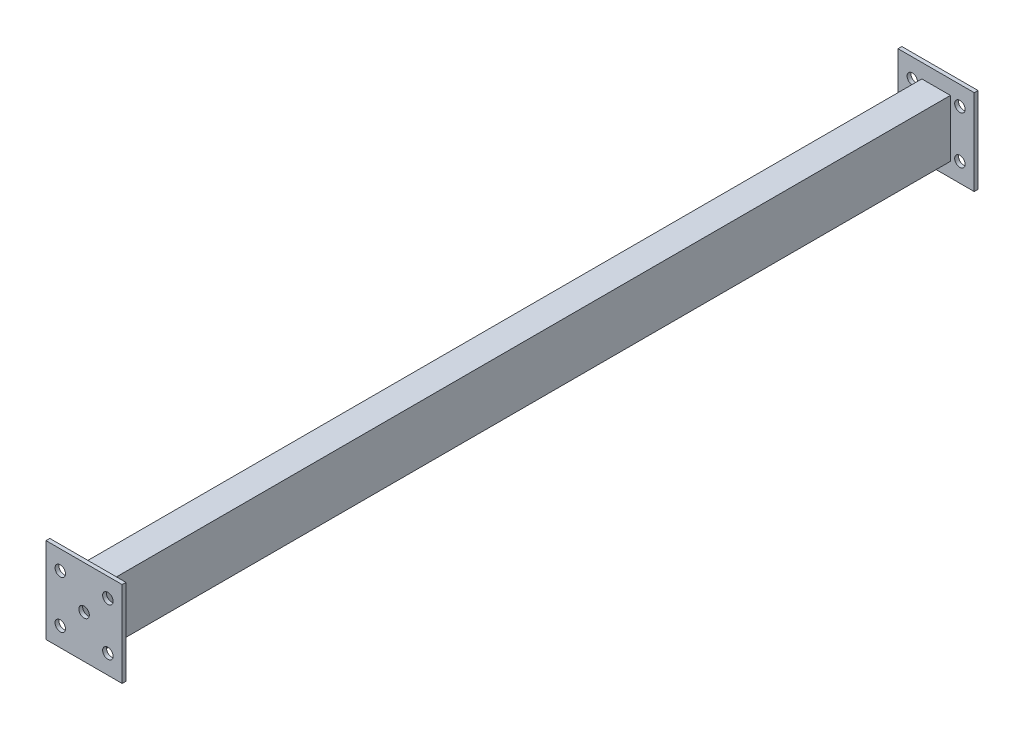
ISO-10303-21;
HEADER;
FILE_DESCRIPTION(('STEP AP214'),'2;1');
FILE_NAME('part.step','',(''),(''),'','','');
FILE_SCHEMA(('AUTOMOTIVE_DESIGN { 1 0 10303 214 1 1 1 1 }'));
ENDSEC;
DATA;
#1=APPLICATION_CONTEXT('core data for automotive mechanical design processes');
#2=APPLICATION_PROTOCOL_DEFINITION('international standard','automotive_design',2000,#1);
#3=PRODUCT_CONTEXT('',#1,'mechanical');
#4=PRODUCT('Part','Part','',(#3));
#5=PRODUCT_RELATED_PRODUCT_CATEGORY('part','',(#4));
#6=PRODUCT_DEFINITION_FORMATION('','',#4);
#7=PRODUCT_DEFINITION_CONTEXT('part definition',#1,'design');
#8=PRODUCT_DEFINITION('design','',#6,#7);
#9=PRODUCT_DEFINITION_SHAPE('','',#8);
#10=(LENGTH_UNIT() NAMED_UNIT(*) SI_UNIT(.MILLI.,.METRE.));
#11=(NAMED_UNIT(*) PLANE_ANGLE_UNIT() SI_UNIT($,.RADIAN.));
#12=(NAMED_UNIT(*) SI_UNIT($,.STERADIAN.) SOLID_ANGLE_UNIT());
#13=UNCERTAINTY_MEASURE_WITH_UNIT(LENGTH_MEASURE(1.E-05),#10,'distance_accuracy_value','');
#14=(GEOMETRIC_REPRESENTATION_CONTEXT(3) GLOBAL_UNCERTAINTY_ASSIGNED_CONTEXT((#13)) GLOBAL_UNIT_ASSIGNED_CONTEXT((#10,
#11,#12)) REPRESENTATION_CONTEXT('',''));
#15=CARTESIAN_POINT('',(0.,0.,0.));
#16=DIRECTION('',(0.,0.,1.));
#17=DIRECTION('',(1.,0.,0.));
#18=AXIS2_PLACEMENT_3D('',#15,#16,#17);
#19=CARTESIAN_POINT('',(-15.,30.,445.5));
#20=DIRECTION('',(1.,0.,0.));
#21=DIRECTION('',(0.,1.,0.));
#22=AXIS2_PLACEMENT_3D('',#19,#20,#21);
#23=PLANE('',#22);
#24=DIRECTION('',(0.,0.,-1.));
#25=VECTOR('',#24,1.);
#26=CARTESIAN_POINT('',(-15.,30.,445.5));
#27=LINE('',#26,#25);
#28=CARTESIAN_POINT('',(-15.,30.,445.5));
#29=VERTEX_POINT('',#28);
#30=CARTESIAN_POINT('',(-15.,30.,-445.5));
#31=VERTEX_POINT('',#30);
#32=EDGE_CURVE('E299',#29,#31,#27,.T.);
#33=ORIENTED_EDGE('',*,*,#32,.T.);
#34=DIRECTION('',(0.,-1.,0.));
#35=VECTOR('',#34,1.);
#36=CARTESIAN_POINT('',(-15.,30.,-445.5));
#37=LINE('',#36,#35);
#38=CARTESIAN_POINT('',(-15.,-30.,-445.5));
#39=VERTEX_POINT('',#38);
#40=EDGE_CURVE('E196',#31,#39,#37,.T.);
#41=ORIENTED_EDGE('',*,*,#40,.T.);
#42=DIRECTION('',(0.,0.,-1.));
#43=VECTOR('',#42,1.);
#44=CARTESIAN_POINT('',(-15.,-30.,445.5));
#45=LINE('',#44,#43);
#46=CARTESIAN_POINT('',(-15.,-30.,445.5));
#47=VERTEX_POINT('',#46);
#48=EDGE_CURVE('E11',#47,#39,#45,.T.);
#49=ORIENTED_EDGE('',*,*,#48,.F.);
#50=DIRECTION('',(0.,-1.,0.));
#51=VECTOR('',#50,1.);
#52=CARTESIAN_POINT('',(-15.,30.,445.5));
#53=LINE('',#52,#51);
#54=EDGE_CURVE('E287',#29,#47,#53,.T.);
#55=ORIENTED_EDGE('',*,*,#54,.F.);
#56=EDGE_LOOP('',(#33,#41,#49,#55));
#57=FACE_BOUND('',#56,.T.);
#58=ADVANCED_FACE('F26',(#57),#23,.F.);
#59=CARTESIAN_POINT('',(-15.,-30.,445.5));
#60=DIRECTION('',(0.,1.,0.));
#61=DIRECTION('',(0.,0.,1.));
#62=AXIS2_PLACEMENT_3D('',#59,#60,#61);
#63=PLANE('',#62);
#64=ORIENTED_EDGE('',*,*,#48,.T.);
#65=DIRECTION('',(1.,0.,0.));
#66=VECTOR('',#65,1.);
#67=CARTESIAN_POINT('',(-15.,-30.,-445.5));
#68=LINE('',#67,#66);
#69=CARTESIAN_POINT('',(15.,-30.,-445.5));
#70=VERTEX_POINT('',#69);
#71=EDGE_CURVE('E204',#39,#70,#68,.T.);
#72=ORIENTED_EDGE('',*,*,#71,.T.);
#73=DIRECTION('',(0.,0.,-1.));
#74=VECTOR('',#73,1.);
#75=CARTESIAN_POINT('',(15.,-30.,445.5));
#76=LINE('',#75,#74);
#77=CARTESIAN_POINT('',(15.,-30.,445.5));
#78=VERTEX_POINT('',#77);
#79=EDGE_CURVE('E33',#78,#70,#76,.T.);
#80=ORIENTED_EDGE('',*,*,#79,.F.);
#81=DIRECTION('',(1.,0.,0.));
#82=VECTOR('',#81,1.);
#83=CARTESIAN_POINT('',(-15.,-30.,445.5));
#84=LINE('',#83,#82);
#85=EDGE_CURVE('E290',#47,#78,#84,.T.);
#86=ORIENTED_EDGE('',*,*,#85,.F.);
#87=EDGE_LOOP('',(#64,#72,#80,#86));
#88=FACE_BOUND('',#87,.T.);
#89=ADVANCED_FACE('F303',(#88),#63,.F.);
#90=CARTESIAN_POINT('',(15.,30.,445.5));
#91=DIRECTION('',(-1.,0.,0.));
#92=DIRECTION('',(0.,-1.,0.));
#93=AXIS2_PLACEMENT_3D('',#90,#91,#92);
#94=PLANE('',#93);
#95=ORIENTED_EDGE('',*,*,#79,.T.);
#96=DIRECTION('',(0.,1.,0.));
#97=VECTOR('',#96,1.);
#98=CARTESIAN_POINT('',(15.,30.,-445.5));
#99=LINE('',#98,#97);
#100=CARTESIAN_POINT('',(15.,30.,-445.5));
#101=VERTEX_POINT('',#100);
#102=EDGE_CURVE('E202',#70,#101,#99,.T.);
#103=ORIENTED_EDGE('',*,*,#102,.T.);
#104=DIRECTION('',(0.,0.,-1.));
#105=VECTOR('',#104,1.);
#106=CARTESIAN_POINT('',(15.,30.,445.5));
#107=LINE('',#106,#105);
#108=CARTESIAN_POINT('',(15.,30.,445.5));
#109=VERTEX_POINT('',#108);
#110=EDGE_CURVE('E40',#109,#101,#107,.T.);
#111=ORIENTED_EDGE('',*,*,#110,.F.);
#112=DIRECTION('',(0.,1.,0.));
#113=VECTOR('',#112,1.);
#114=CARTESIAN_POINT('',(15.,30.,445.5));
#115=LINE('',#114,#113);
#116=EDGE_CURVE('E293',#78,#109,#115,.T.);
#117=ORIENTED_EDGE('',*,*,#116,.F.);
#118=EDGE_LOOP('',(#95,#103,#111,#117));
#119=FACE_BOUND('',#118,.T.);
#120=ADVANCED_FACE('F302',(#119),#94,.F.);
#121=CARTESIAN_POINT('',(-15.,30.,445.5));
#122=DIRECTION('',(0.,-1.,0.));
#123=DIRECTION('',(0.,0.,-1.));
#124=AXIS2_PLACEMENT_3D('',#121,#122,#123);
#125=PLANE('',#124);
#126=ORIENTED_EDGE('',*,*,#110,.T.);
#127=DIRECTION('',(-1.,0.,0.));
#128=VECTOR('',#127,1.);
#129=CARTESIAN_POINT('',(-15.,30.,-445.5));
#130=LINE('',#129,#128);
#131=EDGE_CURVE('E199',#101,#31,#130,.T.);
#132=ORIENTED_EDGE('',*,*,#131,.T.);
#133=ORIENTED_EDGE('',*,*,#32,.F.);
#134=DIRECTION('',(-1.,0.,0.));
#135=VECTOR('',#134,1.);
#136=CARTESIAN_POINT('',(-15.,30.,445.5));
#137=LINE('',#136,#135);
#138=EDGE_CURVE('E296',#109,#29,#137,.T.);
#139=ORIENTED_EDGE('',*,*,#138,.F.);
#140=EDGE_LOOP('',(#126,#132,#133,#139));
#141=FACE_BOUND('',#140,.T.);
#142=ADVANCED_FACE('F307',(#141),#125,.F.);
#143=CARTESIAN_POINT('',(-12.5,27.5,445.5));
#144=DIRECTION('',(1.,0.,0.));
#145=DIRECTION('',(0.,1.,0.));
#146=AXIS2_PLACEMENT_3D('',#143,#144,#145);
#147=PLANE('',#146);
#148=DIRECTION('',(0.,0.,-1.));
#149=VECTOR('',#148,1.);
#150=CARTESIAN_POINT('',(-12.5,-27.5,445.5));
#151=LINE('',#150,#149);
#152=CARTESIAN_POINT('',(-12.5,-27.5,445.5));
#153=VERTEX_POINT('',#152);
#154=CARTESIAN_POINT('',(-12.5,-27.5,-445.5));
#155=VERTEX_POINT('',#154);
#156=EDGE_CURVE('E285',#153,#155,#151,.T.);
#157=ORIENTED_EDGE('',*,*,#156,.T.);
#158=DIRECTION('',(0.,-1.,0.));
#159=VECTOR('',#158,1.);
#160=CARTESIAN_POINT('',(-12.5,27.5,-445.5));
#161=LINE('',#160,#159);
#162=CARTESIAN_POINT('',(-12.5,27.5,-445.5));
#163=VERTEX_POINT('',#162);
#164=EDGE_CURVE('E150',#163,#155,#161,.T.);
#165=ORIENTED_EDGE('',*,*,#164,.F.);
#166=DIRECTION('',(0.,0.,-1.));
#167=VECTOR('',#166,1.);
#168=CARTESIAN_POINT('',(-12.5,27.5,445.5));
#169=LINE('',#168,#167);
#170=CARTESIAN_POINT('',(-12.5,27.5,445.5));
#171=VERTEX_POINT('',#170);
#172=EDGE_CURVE('E278',#171,#163,#169,.T.);
#173=ORIENTED_EDGE('',*,*,#172,.F.);
#174=DIRECTION('',(0.,-1.,0.));
#175=VECTOR('',#174,1.);
#176=CARTESIAN_POINT('',(-12.5,27.5,445.5));
#177=LINE('',#176,#175);
#178=EDGE_CURVE('E266',#171,#153,#177,.T.);
#179=ORIENTED_EDGE('',*,*,#178,.T.);
#180=EDGE_LOOP('',(#157,#165,#173,#179));
#181=FACE_BOUND('',#180,.T.);
#182=ADVANCED_FACE('F323',(#181),#147,.T.);
#183=CARTESIAN_POINT('',(-12.5,-27.5,445.5));
#184=DIRECTION('',(0.,1.,0.));
#185=DIRECTION('',(0.,0.,1.));
#186=AXIS2_PLACEMENT_3D('',#183,#184,#185);
#187=PLANE('',#186);
#188=DIRECTION('',(0.,0.,-1.));
#189=VECTOR('',#188,1.);
#190=CARTESIAN_POINT('',(12.5,-27.5,445.5));
#191=LINE('',#190,#189);
#192=CARTESIAN_POINT('',(12.5,-27.5,445.5));
#193=VERTEX_POINT('',#192);
#194=CARTESIAN_POINT('',(12.5,-27.5,-445.5));
#195=VERTEX_POINT('',#194);
#196=EDGE_CURVE('E283',#193,#195,#191,.T.);
#197=ORIENTED_EDGE('',*,*,#196,.T.);
#198=DIRECTION('',(1.,0.,0.));
#199=VECTOR('',#198,1.);
#200=CARTESIAN_POINT('',(-12.5,-27.5,-445.5));
#201=LINE('',#200,#199);
#202=EDGE_CURVE('E193',#155,#195,#201,.T.);
#203=ORIENTED_EDGE('',*,*,#202,.F.);
#204=ORIENTED_EDGE('',*,*,#156,.F.);
#205=DIRECTION('',(1.,0.,0.));
#206=VECTOR('',#205,1.);
#207=CARTESIAN_POINT('',(-12.5,-27.5,445.5));
#208=LINE('',#207,#206);
#209=EDGE_CURVE('E269',#153,#193,#208,.T.);
#210=ORIENTED_EDGE('',*,*,#209,.T.);
#211=EDGE_LOOP('',(#197,#203,#204,#210));
#212=FACE_BOUND('',#211,.T.);
#213=ADVANCED_FACE('F326',(#212),#187,.T.);
#214=CARTESIAN_POINT('',(12.5,27.5,445.5));
#215=DIRECTION('',(-1.,0.,0.));
#216=DIRECTION('',(0.,-1.,0.));
#217=AXIS2_PLACEMENT_3D('',#214,#215,#216);
#218=PLANE('',#217);
#219=DIRECTION('',(0.,0.,-1.));
#220=VECTOR('',#219,1.);
#221=CARTESIAN_POINT('',(12.5,27.5,445.5));
#222=LINE('',#221,#220);
#223=CARTESIAN_POINT('',(12.5,27.5,445.5));
#224=VERTEX_POINT('',#223);
#225=CARTESIAN_POINT('',(12.5,27.5,-445.5));
#226=VERTEX_POINT('',#225);
#227=EDGE_CURVE('E281',#224,#226,#222,.T.);
#228=ORIENTED_EDGE('',*,*,#227,.T.);
#229=DIRECTION('',(0.,1.,0.));
#230=VECTOR('',#229,1.);
#231=CARTESIAN_POINT('',(12.5,27.5,-445.5));
#232=LINE('',#231,#230);
#233=EDGE_CURVE('E190',#195,#226,#232,.T.);
#234=ORIENTED_EDGE('',*,*,#233,.F.);
#235=ORIENTED_EDGE('',*,*,#196,.F.);
#236=DIRECTION('',(0.,1.,0.));
#237=VECTOR('',#236,1.);
#238=CARTESIAN_POINT('',(12.5,27.5,445.5));
#239=LINE('',#238,#237);
#240=EDGE_CURVE('E272',#193,#224,#239,.T.);
#241=ORIENTED_EDGE('',*,*,#240,.T.);
#242=EDGE_LOOP('',(#228,#234,#235,#241));
#243=FACE_BOUND('',#242,.T.);
#244=ADVANCED_FACE('F330',(#243),#218,.T.);
#245=CARTESIAN_POINT('',(-12.5,27.5,445.5));
#246=DIRECTION('',(0.,-1.,0.));
#247=DIRECTION('',(0.,0.,-1.));
#248=AXIS2_PLACEMENT_3D('',#245,#246,#247);
#249=PLANE('',#248);
#250=ORIENTED_EDGE('',*,*,#172,.T.);
#251=DIRECTION('',(-1.,0.,0.));
#252=VECTOR('',#251,1.);
#253=CARTESIAN_POINT('',(-12.5,27.5,-445.5));
#254=LINE('',#253,#252);
#255=EDGE_CURVE('E187',#226,#163,#254,.T.);
#256=ORIENTED_EDGE('',*,*,#255,.F.);
#257=ORIENTED_EDGE('',*,*,#227,.F.);
#258=DIRECTION('',(-1.,0.,0.));
#259=VECTOR('',#258,1.);
#260=CARTESIAN_POINT('',(-12.5,27.5,445.5));
#261=LINE('',#260,#259);
#262=EDGE_CURVE('E275',#224,#171,#261,.T.);
#263=ORIENTED_EDGE('',*,*,#262,.T.);
#264=EDGE_LOOP('',(#250,#256,#257,#263));
#265=FACE_BOUND('',#264,.T.);
#266=ADVANCED_FACE('F334',(#265),#249,.T.);
#267=CARTESIAN_POINT('',(-40.,-45.,445.5));
#268=DIRECTION('',(0.,0.,1.));
#269=DIRECTION('',(1.,0.,0.));
#270=AXIS2_PLACEMENT_3D('',#267,#268,#269);
#271=PLANE('',#270);
#272=CARTESIAN_POINT('',(25.,-25.,445.5));
#273=DIRECTION('',(0.,0.,1.));
#274=DIRECTION('',(1.,0.,0.));
#275=AXIS2_PLACEMENT_3D('',#272,#273,#274);
#276=CIRCLE('',#275,5.5);
#277=CARTESIAN_POINT('',(30.5,-25.,445.5));
#278=VERTEX_POINT('',#277);
#279=EDGE_CURVE('E212',#278,#278,#276,.T.);
#280=ORIENTED_EDGE('',*,*,#279,.T.);
#281=EDGE_LOOP('',(#280));
#282=FACE_BOUND('',#281,.T.);
#283=CARTESIAN_POINT('',(25.,25.,445.5));
#284=DIRECTION('',(0.,0.,1.));
#285=DIRECTION('',(1.,0.,0.));
#286=AXIS2_PLACEMENT_3D('',#283,#284,#285);
#287=CIRCLE('',#286,5.5);
#288=CARTESIAN_POINT('',(30.5,25.,445.5));
#289=VERTEX_POINT('',#288);
#290=EDGE_CURVE('E224',#289,#289,#287,.T.);
#291=ORIENTED_EDGE('',*,*,#290,.T.);
#292=EDGE_LOOP('',(#291));
#293=FACE_BOUND('',#292,.T.);
#294=DIRECTION('',(0.,-1.,0.));
#295=VECTOR('',#294,1.);
#296=CARTESIAN_POINT('',(-40.,45.,445.5));
#297=LINE('',#296,#295);
#298=CARTESIAN_POINT('',(-40.,45.,445.5));
#299=VERTEX_POINT('',#298);
#300=CARTESIAN_POINT('',(-40.,-45.,445.5));
#301=VERTEX_POINT('',#300);
#302=EDGE_CURVE('E236',#299,#301,#297,.T.);
#303=ORIENTED_EDGE('',*,*,#302,.F.);
#304=DIRECTION('',(-1.,0.,0.));
#305=VECTOR('',#304,1.);
#306=CARTESIAN_POINT('',(-40.,45.,445.5));
#307=LINE('',#306,#305);
#308=CARTESIAN_POINT('',(40.,45.,445.5));
#309=VERTEX_POINT('',#308);
#310=EDGE_CURVE('E243',#309,#299,#307,.T.);
#311=ORIENTED_EDGE('',*,*,#310,.F.);
#312=DIRECTION('',(0.,1.,0.));
#313=VECTOR('',#312,1.);
#314=CARTESIAN_POINT('',(40.,45.,445.5));
#315=LINE('',#314,#313);
#316=CARTESIAN_POINT('',(40.,-45.,445.5));
#317=VERTEX_POINT('',#316);
#318=EDGE_CURVE('E241',#317,#309,#315,.T.);
#319=ORIENTED_EDGE('',*,*,#318,.F.);
#320=DIRECTION('',(1.,0.,0.));
#321=VECTOR('',#320,1.);
#322=CARTESIAN_POINT('',(-40.,-45.,445.5));
#323=LINE('',#322,#321);
#324=EDGE_CURVE('E239',#301,#317,#323,.T.);
#325=ORIENTED_EDGE('',*,*,#324,.F.);
#326=EDGE_LOOP('',(#303,#311,#319,#325));
#327=FACE_BOUND('',#326,.T.);
#328=CARTESIAN_POINT('',(-25.,25.,445.5));
#329=DIRECTION('',(0.,0.,1.));
#330=DIRECTION('',(1.,0.,0.));
#331=AXIS2_PLACEMENT_3D('',#328,#329,#330);
#332=CIRCLE('',#331,5.5);
#333=CARTESIAN_POINT('',(-19.5,25.,445.5));
#334=VERTEX_POINT('',#333);
#335=EDGE_CURVE('E230',#334,#334,#332,.T.);
#336=ORIENTED_EDGE('',*,*,#335,.T.);
#337=EDGE_LOOP('',(#336));
#338=FACE_BOUND('',#337,.T.);
#339=CARTESIAN_POINT('',(-25.,-25.,445.5));
#340=DIRECTION('',(0.,0.,1.));
#341=DIRECTION('',(1.,0.,0.));
#342=AXIS2_PLACEMENT_3D('',#339,#340,#341);
#343=CIRCLE('',#342,5.5);
#344=CARTESIAN_POINT('',(-19.5,-25.,445.5));
#345=VERTEX_POINT('',#344);
#346=EDGE_CURVE('E218',#345,#345,#343,.T.);
#347=ORIENTED_EDGE('',*,*,#346,.T.);
#348=EDGE_LOOP('',(#347));
#349=FACE_BOUND('',#348,.T.);
#350=ORIENTED_EDGE('',*,*,#138,.T.);
#351=ORIENTED_EDGE('',*,*,#54,.T.);
#352=ORIENTED_EDGE('',*,*,#85,.T.);
#353=ORIENTED_EDGE('',*,*,#116,.T.);
#354=EDGE_LOOP('',(#350,#351,#352,#353));
#355=FACE_BOUND('',#354,.T.);
#356=ADVANCED_FACE('F309',(#282,#293,#327,#338,#349,#355),#271,.F.);
#357=CARTESIAN_POINT('',(-40.,-45.,449.5));
#358=DIRECTION('',(0.,0.,1.));
#359=DIRECTION('',(1.,0.,0.));
#360=AXIS2_PLACEMENT_3D('',#357,#358,#359);
#361=PLANE('',#360);
#362=CARTESIAN_POINT('',(25.,-25.,449.5));
#363=DIRECTION('',(0.,0.,1.));
#364=DIRECTION('',(1.,0.,0.));
#365=AXIS2_PLACEMENT_3D('',#362,#363,#364);
#366=CIRCLE('',#365,5.5);
#367=CARTESIAN_POINT('',(30.5,-25.,449.5));
#368=VERTEX_POINT('',#367);
#369=EDGE_CURVE('E215',#368,#368,#366,.T.);
#370=ORIENTED_EDGE('',*,*,#369,.F.);
#371=EDGE_LOOP('',(#370));
#372=FACE_BOUND('',#371,.T.);
#373=CARTESIAN_POINT('',(25.,25.,449.5));
#374=DIRECTION('',(0.,0.,1.));
#375=DIRECTION('',(1.,0.,0.));
#376=AXIS2_PLACEMENT_3D('',#373,#374,#375);
#377=CIRCLE('',#376,5.5);
#378=CARTESIAN_POINT('',(30.5,25.,449.5));
#379=VERTEX_POINT('',#378);
#380=EDGE_CURVE('E227',#379,#379,#377,.T.);
#381=ORIENTED_EDGE('',*,*,#380,.F.);
#382=EDGE_LOOP('',(#381));
#383=FACE_BOUND('',#382,.T.);
#384=DIRECTION('',(0.,-1.,0.));
#385=VECTOR('',#384,1.);
#386=CARTESIAN_POINT('',(-40.,45.,449.5));
#387=LINE('',#386,#385);
#388=CARTESIAN_POINT('',(-40.,45.,449.5));
#389=VERTEX_POINT('',#388);
#390=CARTESIAN_POINT('',(-40.,-45.,449.5));
#391=VERTEX_POINT('',#390);
#392=EDGE_CURVE('E245',#389,#391,#387,.T.);
#393=ORIENTED_EDGE('',*,*,#392,.T.);
#394=DIRECTION('',(1.,0.,0.));
#395=VECTOR('',#394,1.);
#396=CARTESIAN_POINT('',(-40.,-45.,449.5));
#397=LINE('',#396,#395);
#398=CARTESIAN_POINT('',(40.,-45.,449.5));
#399=VERTEX_POINT('',#398);
#400=EDGE_CURVE('E248',#391,#399,#397,.T.);
#401=ORIENTED_EDGE('',*,*,#400,.T.);
#402=DIRECTION('',(0.,1.,0.));
#403=VECTOR('',#402,1.);
#404=CARTESIAN_POINT('',(40.,45.,449.5));
#405=LINE('',#404,#403);
#406=CARTESIAN_POINT('',(40.,45.,449.5));
#407=VERTEX_POINT('',#406);
#408=EDGE_CURVE('E250',#399,#407,#405,.T.);
#409=ORIENTED_EDGE('',*,*,#408,.T.);
#410=DIRECTION('',(-1.,0.,0.));
#411=VECTOR('',#410,1.);
#412=CARTESIAN_POINT('',(-40.,45.,449.5));
#413=LINE('',#412,#411);
#414=EDGE_CURVE('E252',#407,#389,#413,.T.);
#415=ORIENTED_EDGE('',*,*,#414,.T.);
#416=EDGE_LOOP('',(#393,#401,#409,#415));
#417=FACE_BOUND('',#416,.T.);
#418=CARTESIAN_POINT('',(-25.,25.,449.5));
#419=DIRECTION('',(0.,0.,1.));
#420=DIRECTION('',(1.,0.,0.));
#421=AXIS2_PLACEMENT_3D('',#418,#419,#420);
#422=CIRCLE('',#421,5.5);
#423=CARTESIAN_POINT('',(-19.5,25.,449.5));
#424=VERTEX_POINT('',#423);
#425=EDGE_CURVE('E233',#424,#424,#422,.T.);
#426=ORIENTED_EDGE('',*,*,#425,.F.);
#427=EDGE_LOOP('',(#426));
#428=FACE_BOUND('',#427,.T.);
#429=CARTESIAN_POINT('',(-25.,-25.,449.5));
#430=DIRECTION('',(0.,0.,1.));
#431=DIRECTION('',(1.,0.,0.));
#432=AXIS2_PLACEMENT_3D('',#429,#430,#431);
#433=CIRCLE('',#432,5.5);
#434=CARTESIAN_POINT('',(-19.5,-25.,449.5));
#435=VERTEX_POINT('',#434);
#436=EDGE_CURVE('E221',#435,#435,#433,.T.);
#437=ORIENTED_EDGE('',*,*,#436,.F.);
#438=EDGE_LOOP('',(#437));
#439=FACE_BOUND('',#438,.T.);
#440=CARTESIAN_POINT('',(0.,0.,449.5));
#441=DIRECTION('',(0.,0.,1.));
#442=DIRECTION('',(1.,0.,0.));
#443=AXIS2_PLACEMENT_3D('',#440,#441,#442);
#444=CIRCLE('',#443,5.5);
#445=CARTESIAN_POINT('',(5.5,0.,449.5));
#446=VERTEX_POINT('',#445);
#447=EDGE_CURVE('E209',#446,#446,#444,.T.);
#448=ORIENTED_EDGE('',*,*,#447,.F.);
#449=EDGE_LOOP('',(#448));
#450=FACE_BOUND('',#449,.T.);
#451=ADVANCED_FACE('F357',(#372,#383,#417,#428,#439,#450),#361,.T.);
#452=ORIENTED_EDGE('',*,*,#178,.F.);
#453=ORIENTED_EDGE('',*,*,#262,.F.);
#454=ORIENTED_EDGE('',*,*,#240,.F.);
#455=ORIENTED_EDGE('',*,*,#209,.F.);
#456=EDGE_LOOP('',(#452,#453,#454,#455));
#457=FACE_BOUND('',#456,.T.);
#458=CARTESIAN_POINT('',(0.,0.,445.5));
#459=DIRECTION('',(0.,0.,1.));
#460=DIRECTION('',(1.,0.,0.));
#461=AXIS2_PLACEMENT_3D('',#458,#459,#460);
#462=CIRCLE('',#461,5.5);
#463=CARTESIAN_POINT('',(5.5,0.,445.5));
#464=VERTEX_POINT('',#463);
#465=EDGE_CURVE('E206',#464,#464,#462,.T.);
#466=ORIENTED_EDGE('',*,*,#465,.T.);
#467=EDGE_LOOP('',(#466));
#468=FACE_BOUND('',#467,.T.);
#469=ADVANCED_FACE('F343',(#457,#468),#271,.F.);
#470=CARTESIAN_POINT('',(-40.,45.,449.5));
#471=DIRECTION('',(1.,0.,0.));
#472=DIRECTION('',(0.,1.,0.));
#473=AXIS2_PLACEMENT_3D('',#470,#471,#472);
#474=PLANE('',#473);
#475=ORIENTED_EDGE('',*,*,#302,.T.);
#476=DIRECTION('',(0.,0.,-1.));
#477=VECTOR('',#476,1.);
#478=CARTESIAN_POINT('',(-40.,-45.,449.5));
#479=LINE('',#478,#477);
#480=EDGE_CURVE('E263',#391,#301,#479,.T.);
#481=ORIENTED_EDGE('',*,*,#480,.F.);
#482=ORIENTED_EDGE('',*,*,#392,.F.);
#483=DIRECTION('',(0.,0.,-1.));
#484=VECTOR('',#483,1.);
#485=CARTESIAN_POINT('',(-40.,45.,449.5));
#486=LINE('',#485,#484);
#487=EDGE_CURVE('E254',#389,#299,#486,.T.);
#488=ORIENTED_EDGE('',*,*,#487,.T.);
#489=EDGE_LOOP('',(#475,#481,#482,#488));
#490=FACE_BOUND('',#489,.T.);
#491=ADVANCED_FACE('F339',(#490),#474,.F.);
#492=CARTESIAN_POINT('',(-40.,-45.,449.5));
#493=DIRECTION('',(0.,1.,0.));
#494=DIRECTION('',(0.,0.,1.));
#495=AXIS2_PLACEMENT_3D('',#492,#493,#494);
#496=PLANE('',#495);
#497=ORIENTED_EDGE('',*,*,#324,.T.);
#498=DIRECTION('',(0.,0.,-1.));
#499=VECTOR('',#498,1.);
#500=CARTESIAN_POINT('',(40.,-45.,449.5));
#501=LINE('',#500,#499);
#502=EDGE_CURVE('E260',#399,#317,#501,.T.);
#503=ORIENTED_EDGE('',*,*,#502,.F.);
#504=ORIENTED_EDGE('',*,*,#400,.F.);
#505=ORIENTED_EDGE('',*,*,#480,.T.);
#506=EDGE_LOOP('',(#497,#503,#504,#505));
#507=FACE_BOUND('',#506,.T.);
#508=ADVANCED_FACE('F342',(#507),#496,.F.);
#509=CARTESIAN_POINT('',(40.,45.,449.5));
#510=DIRECTION('',(-1.,0.,0.));
#511=DIRECTION('',(0.,-1.,0.));
#512=AXIS2_PLACEMENT_3D('',#509,#510,#511);
#513=PLANE('',#512);
#514=ORIENTED_EDGE('',*,*,#318,.T.);
#515=DIRECTION('',(0.,0.,-1.));
#516=VECTOR('',#515,1.);
#517=CARTESIAN_POINT('',(40.,45.,449.5));
#518=LINE('',#517,#516);
#519=EDGE_CURVE('E257',#407,#309,#518,.T.);
#520=ORIENTED_EDGE('',*,*,#519,.F.);
#521=ORIENTED_EDGE('',*,*,#408,.F.);
#522=ORIENTED_EDGE('',*,*,#502,.T.);
#523=EDGE_LOOP('',(#514,#520,#521,#522));
#524=FACE_BOUND('',#523,.T.);
#525=ADVANCED_FACE('F347',(#524),#513,.F.);
#526=CARTESIAN_POINT('',(-40.,45.,449.5));
#527=DIRECTION('',(0.,-1.,0.));
#528=DIRECTION('',(0.,0.,-1.));
#529=AXIS2_PLACEMENT_3D('',#526,#527,#528);
#530=PLANE('',#529);
#531=ORIENTED_EDGE('',*,*,#310,.T.);
#532=ORIENTED_EDGE('',*,*,#487,.F.);
#533=ORIENTED_EDGE('',*,*,#414,.F.);
#534=ORIENTED_EDGE('',*,*,#519,.T.);
#535=EDGE_LOOP('',(#531,#532,#533,#534));
#536=FACE_BOUND('',#535,.T.);
#537=ADVANCED_FACE('F351',(#536),#530,.F.);
#538=CARTESIAN_POINT('',(-25.,25.,449.5));
#539=DIRECTION('',(0.,0.,-1.));
#540=DIRECTION('',(-1.,0.,0.));
#541=AXIS2_PLACEMENT_3D('',#538,#539,#540);
#542=CYLINDRICAL_SURFACE('',#541,5.5);
#543=ORIENTED_EDGE('',*,*,#425,.T.);
#544=EDGE_LOOP('',(#543));
#545=FACE_BOUND('',#544,.T.);
#546=ORIENTED_EDGE('',*,*,#335,.F.);
#547=EDGE_LOOP('',(#546));
#548=FACE_BOUND('',#547,.T.);
#549=ADVANCED_FACE('F355',(#545,#548),#542,.F.);
#550=CARTESIAN_POINT('',(25.,25.,449.5));
#551=DIRECTION('',(0.,0.,-1.));
#552=DIRECTION('',(-1.,0.,0.));
#553=AXIS2_PLACEMENT_3D('',#550,#551,#552);
#554=CYLINDRICAL_SURFACE('',#553,5.5);
#555=ORIENTED_EDGE('',*,*,#380,.T.);
#556=EDGE_LOOP('',(#555));
#557=FACE_BOUND('',#556,.T.);
#558=ORIENTED_EDGE('',*,*,#290,.F.);
#559=EDGE_LOOP('',(#558));
#560=FACE_BOUND('',#559,.T.);
#561=ADVANCED_FACE('F366',(#557,#560),#554,.F.);
#562=CARTESIAN_POINT('',(-25.,-25.,449.5));
#563=DIRECTION('',(0.,0.,-1.));
#564=DIRECTION('',(-1.,0.,0.));
#565=AXIS2_PLACEMENT_3D('',#562,#563,#564);
#566=CYLINDRICAL_SURFACE('',#565,5.5);
#567=ORIENTED_EDGE('',*,*,#436,.T.);
#568=EDGE_LOOP('',(#567));
#569=FACE_BOUND('',#568,.T.);
#570=ORIENTED_EDGE('',*,*,#346,.F.);
#571=EDGE_LOOP('',(#570));
#572=FACE_BOUND('',#571,.T.);
#573=ADVANCED_FACE('F370',(#569,#572),#566,.F.);
#574=CARTESIAN_POINT('',(25.,-25.,449.5));
#575=DIRECTION('',(0.,0.,-1.));
#576=DIRECTION('',(-1.,0.,0.));
#577=AXIS2_PLACEMENT_3D('',#574,#575,#576);
#578=CYLINDRICAL_SURFACE('',#577,5.5);
#579=ORIENTED_EDGE('',*,*,#369,.T.);
#580=EDGE_LOOP('',(#579));
#581=FACE_BOUND('',#580,.T.);
#582=ORIENTED_EDGE('',*,*,#279,.F.);
#583=EDGE_LOOP('',(#582));
#584=FACE_BOUND('',#583,.T.);
#585=ADVANCED_FACE('F374',(#581,#584),#578,.F.);
#586=CARTESIAN_POINT('',(0.,0.,449.5));
#587=DIRECTION('',(0.,0.,-1.));
#588=DIRECTION('',(-1.,0.,0.));
#589=AXIS2_PLACEMENT_3D('',#586,#587,#588);
#590=CYLINDRICAL_SURFACE('',#589,5.5);
#591=ORIENTED_EDGE('',*,*,#447,.T.);
#592=EDGE_LOOP('',(#591));
#593=FACE_BOUND('',#592,.T.);
#594=ORIENTED_EDGE('',*,*,#465,.F.);
#595=EDGE_LOOP('',(#594));
#596=FACE_BOUND('',#595,.T.);
#597=ADVANCED_FACE('F378',(#593,#596),#590,.F.);
#598=CARTESIAN_POINT('',(-40.,-45.,-445.5));
#599=DIRECTION('',(0.,0.,-1.));
#600=DIRECTION('',(1.,0.,0.));
#601=AXIS2_PLACEMENT_3D('',#598,#599,#600);
#602=PLANE('',#601);
#603=CARTESIAN_POINT('',(25.,-25.,-445.5));
#604=DIRECTION('',(0.,0.,1.));
#605=DIRECTION('',(1.,0.,0.));
#606=AXIS2_PLACEMENT_3D('',#603,#604,#605);
#607=CIRCLE('',#606,5.5);
#608=CARTESIAN_POINT('',(30.5,-25.,-445.5));
#609=VERTEX_POINT('',#608);
#610=EDGE_CURVE('E432',#609,#609,#607,.T.);
#611=ORIENTED_EDGE('',*,*,#610,.F.);
#612=EDGE_LOOP('',(#611));
#613=FACE_BOUND('',#612,.T.);
#614=CARTESIAN_POINT('',(-25.,-25.,-445.5));
#615=DIRECTION('',(0.,0.,1.));
#616=DIRECTION('',(1.,0.,0.));
#617=AXIS2_PLACEMENT_3D('',#614,#615,#616);
#618=CIRCLE('',#617,5.5);
#619=CARTESIAN_POINT('',(-19.5,-25.,-445.5));
#620=VERTEX_POINT('',#619);
#621=EDGE_CURVE('E440',#620,#620,#618,.T.);
#622=ORIENTED_EDGE('',*,*,#621,.F.);
#623=EDGE_LOOP('',(#622));
#624=FACE_BOUND('',#623,.T.);
#625=CARTESIAN_POINT('',(25.,25.,-445.5));
#626=DIRECTION('',(0.,0.,1.));
#627=DIRECTION('',(1.,0.,0.));
#628=AXIS2_PLACEMENT_3D('',#625,#626,#627);
#629=CIRCLE('',#628,5.5);
#630=CARTESIAN_POINT('',(30.5,25.,-445.5));
#631=VERTEX_POINT('',#630);
#632=EDGE_CURVE('E446',#631,#631,#629,.T.);
#633=ORIENTED_EDGE('',*,*,#632,.F.);
#634=EDGE_LOOP('',(#633));
#635=FACE_BOUND('',#634,.T.);
#636=CARTESIAN_POINT('',(-25.,25.,-445.5));
#637=DIRECTION('',(0.,0.,1.));
#638=DIRECTION('',(1.,0.,0.));
#639=AXIS2_PLACEMENT_3D('',#636,#637,#638);
#640=CIRCLE('',#639,5.5);
#641=CARTESIAN_POINT('',(-19.5,25.,-445.5));
#642=VERTEX_POINT('',#641);
#643=EDGE_CURVE('E452',#642,#642,#640,.T.);
#644=ORIENTED_EDGE('',*,*,#643,.F.);
#645=EDGE_LOOP('',(#644));
#646=FACE_BOUND('',#645,.T.);
#647=DIRECTION('',(0.,-1.,0.));
#648=VECTOR('',#647,1.);
#649=CARTESIAN_POINT('',(-40.,45.,-445.5));
#650=LINE('',#649,#648);
#651=CARTESIAN_POINT('',(-40.,45.,-445.5));
#652=VERTEX_POINT('',#651);
#653=CARTESIAN_POINT('',(-40.,-45.,-445.5));
#654=VERTEX_POINT('',#653);
#655=EDGE_CURVE('E154',#652,#654,#650,.T.);
#656=ORIENTED_EDGE('',*,*,#655,.T.);
#657=DIRECTION('',(1.,0.,0.));
#658=VECTOR('',#657,1.);
#659=CARTESIAN_POINT('',(-40.,-45.,-445.5));
#660=LINE('',#659,#658);
#661=CARTESIAN_POINT('',(40.,-45.,-445.5));
#662=VERTEX_POINT('',#661);
#663=EDGE_CURVE('E167',#654,#662,#660,.T.);
#664=ORIENTED_EDGE('',*,*,#663,.T.);
#665=DIRECTION('',(0.,1.,0.));
#666=VECTOR('',#665,1.);
#667=CARTESIAN_POINT('',(40.,45.,-445.5));
#668=LINE('',#667,#666);
#669=CARTESIAN_POINT('',(40.,45.,-445.5));
#670=VERTEX_POINT('',#669);
#671=EDGE_CURVE('E165',#662,#670,#668,.T.);
#672=ORIENTED_EDGE('',*,*,#671,.T.);
#673=DIRECTION('',(-1.,0.,0.));
#674=VECTOR('',#673,1.);
#675=CARTESIAN_POINT('',(-40.,45.,-445.5));
#676=LINE('',#675,#674);
#677=EDGE_CURVE('E143',#670,#652,#676,.T.);
#678=ORIENTED_EDGE('',*,*,#677,.T.);
#679=EDGE_LOOP('',(#656,#664,#672,#678));
#680=FACE_BOUND('',#679,.T.);
#681=ORIENTED_EDGE('',*,*,#71,.F.);
#682=ORIENTED_EDGE('',*,*,#40,.F.);
#683=ORIENTED_EDGE('',*,*,#131,.F.);
#684=ORIENTED_EDGE('',*,*,#102,.F.);
#685=EDGE_LOOP('',(#681,#682,#683,#684));
#686=FACE_BOUND('',#685,.T.);
#687=ADVANCED_FACE('F162',(#613,#624,#635,#646,#680,#686),#602,.F.);
#688=CARTESIAN_POINT('',(-40.,45.,-449.5));
#689=DIRECTION('',(-1.,0.,0.));
#690=DIRECTION('',(0.,-1.,0.));
#691=AXIS2_PLACEMENT_3D('',#688,#689,#690);
#692=PLANE('',#691);
#693=ORIENTED_EDGE('',*,*,#655,.F.);
#694=DIRECTION('',(0.,0.,1.));
#695=VECTOR('',#694,1.);
#696=CARTESIAN_POINT('',(-40.,45.,-449.5));
#697=LINE('',#696,#695);
#698=CARTESIAN_POINT('',(-40.,45.,-449.5));
#699=VERTEX_POINT('',#698);
#700=EDGE_CURVE('E139',#699,#652,#697,.T.);
#701=ORIENTED_EDGE('',*,*,#700,.F.);
#702=DIRECTION('',(0.,-1.,0.));
#703=VECTOR('',#702,1.);
#704=CARTESIAN_POINT('',(-40.,45.,-449.5));
#705=LINE('',#704,#703);
#706=CARTESIAN_POINT('',(-40.,-45.,-449.5));
#707=VERTEX_POINT('',#706);
#708=EDGE_CURVE('E172',#699,#707,#705,.T.);
#709=ORIENTED_EDGE('',*,*,#708,.T.);
#710=DIRECTION('',(0.,0.,1.));
#711=VECTOR('',#710,1.);
#712=CARTESIAN_POINT('',(-40.,-45.,-449.5));
#713=LINE('',#712,#711);
#714=EDGE_CURVE('E156',#707,#654,#713,.T.);
#715=ORIENTED_EDGE('',*,*,#714,.T.);
#716=EDGE_LOOP('',(#693,#701,#709,#715));
#717=FACE_BOUND('',#716,.T.);
#718=ADVANCED_FACE('F155',(#717),#692,.T.);
#719=CARTESIAN_POINT('',(-40.,45.,-449.5));
#720=DIRECTION('',(0.,1.,0.));
#721=DIRECTION('',(0.,0.,1.));
#722=AXIS2_PLACEMENT_3D('',#719,#720,#721);
#723=PLANE('',#722);
#724=ORIENTED_EDGE('',*,*,#677,.F.);
#725=DIRECTION('',(0.,0.,1.));
#726=VECTOR('',#725,1.);
#727=CARTESIAN_POINT('',(40.,45.,-449.5));
#728=LINE('',#727,#726);
#729=CARTESIAN_POINT('',(40.,45.,-449.5));
#730=VERTEX_POINT('',#729);
#731=EDGE_CURVE('E151',#730,#670,#728,.T.);
#732=ORIENTED_EDGE('',*,*,#731,.F.);
#733=DIRECTION('',(-1.,0.,0.));
#734=VECTOR('',#733,1.);
#735=CARTESIAN_POINT('',(-40.,45.,-449.5));
#736=LINE('',#735,#734);
#737=EDGE_CURVE('E146',#730,#699,#736,.T.);
#738=ORIENTED_EDGE('',*,*,#737,.T.);
#739=ORIENTED_EDGE('',*,*,#700,.T.);
#740=EDGE_LOOP('',(#724,#732,#738,#739));
#741=FACE_BOUND('',#740,.T.);
#742=ADVANCED_FACE('F141',(#741),#723,.T.);
#743=CARTESIAN_POINT('',(40.,45.,-449.5));
#744=DIRECTION('',(1.,0.,0.));
#745=DIRECTION('',(0.,1.,0.));
#746=AXIS2_PLACEMENT_3D('',#743,#744,#745);
#747=PLANE('',#746);
#748=ORIENTED_EDGE('',*,*,#671,.F.);
#749=DIRECTION('',(0.,0.,1.));
#750=VECTOR('',#749,1.);
#751=CARTESIAN_POINT('',(40.,-45.,-449.5));
#752=LINE('',#751,#750);
#753=CARTESIAN_POINT('',(40.,-45.,-449.5));
#754=VERTEX_POINT('',#753);
#755=EDGE_CURVE('E182',#754,#662,#752,.T.);
#756=ORIENTED_EDGE('',*,*,#755,.F.);
#757=DIRECTION('',(0.,1.,0.));
#758=VECTOR('',#757,1.);
#759=CARTESIAN_POINT('',(40.,45.,-449.5));
#760=LINE('',#759,#758);
#761=EDGE_CURVE('E175',#754,#730,#760,.T.);
#762=ORIENTED_EDGE('',*,*,#761,.T.);
#763=ORIENTED_EDGE('',*,*,#731,.T.);
#764=EDGE_LOOP('',(#748,#756,#762,#763));
#765=FACE_BOUND('',#764,.T.);
#766=ADVANCED_FACE('F386',(#765),#747,.T.);
#767=CARTESIAN_POINT('',(-40.,-45.,-449.5));
#768=DIRECTION('',(0.,-1.,0.));
#769=DIRECTION('',(0.,0.,-1.));
#770=AXIS2_PLACEMENT_3D('',#767,#768,#769);
#771=PLANE('',#770);
#772=ORIENTED_EDGE('',*,*,#663,.F.);
#773=ORIENTED_EDGE('',*,*,#714,.F.);
#774=DIRECTION('',(1.,0.,0.));
#775=VECTOR('',#774,1.);
#776=CARTESIAN_POINT('',(-40.,-45.,-449.5));
#777=LINE('',#776,#775);
#778=EDGE_CURVE('E178',#707,#754,#777,.T.);
#779=ORIENTED_EDGE('',*,*,#778,.T.);
#780=ORIENTED_EDGE('',*,*,#755,.T.);
#781=EDGE_LOOP('',(#772,#773,#779,#780));
#782=FACE_BOUND('',#781,.T.);
#783=ADVANCED_FACE('F389',(#782),#771,.T.);
#784=CARTESIAN_POINT('',(-40.,-45.,-449.5));
#785=DIRECTION('',(0.,0.,-1.));
#786=DIRECTION('',(1.,0.,0.));
#787=AXIS2_PLACEMENT_3D('',#784,#785,#786);
#788=PLANE('',#787);
#789=CARTESIAN_POINT('',(0.,0.,-449.5));
#790=DIRECTION('',(0.,0.,1.));
#791=DIRECTION('',(1.,0.,0.));
#792=AXIS2_PLACEMENT_3D('',#789,#790,#791);
#793=CIRCLE('',#792,5.5);
#794=CARTESIAN_POINT('',(5.5,0.,-449.5));
#795=VERTEX_POINT('',#794);
#796=EDGE_CURVE('E426',#795,#795,#793,.T.);
#797=ORIENTED_EDGE('',*,*,#796,.T.);
#798=EDGE_LOOP('',(#797));
#799=FACE_BOUND('',#798,.T.);
#800=CARTESIAN_POINT('',(25.,-25.,-449.5));
#801=DIRECTION('',(0.,0.,1.));
#802=DIRECTION('',(1.,0.,0.));
#803=AXIS2_PLACEMENT_3D('',#800,#801,#802);
#804=CIRCLE('',#803,5.5);
#805=CARTESIAN_POINT('',(30.5,-25.,-449.5));
#806=VERTEX_POINT('',#805);
#807=EDGE_CURVE('E437',#806,#806,#804,.T.);
#808=ORIENTED_EDGE('',*,*,#807,.T.);
#809=EDGE_LOOP('',(#808));
#810=FACE_BOUND('',#809,.T.);
#811=CARTESIAN_POINT('',(-25.,-25.,-449.5));
#812=DIRECTION('',(0.,0.,1.));
#813=DIRECTION('',(1.,0.,0.));
#814=AXIS2_PLACEMENT_3D('',#811,#812,#813);
#815=CIRCLE('',#814,5.5);
#816=CARTESIAN_POINT('',(-19.5,-25.,-449.5));
#817=VERTEX_POINT('',#816);
#818=EDGE_CURVE('E443',#817,#817,#815,.T.);
#819=ORIENTED_EDGE('',*,*,#818,.T.);
#820=EDGE_LOOP('',(#819));
#821=FACE_BOUND('',#820,.T.);
#822=CARTESIAN_POINT('',(25.,25.,-449.5));
#823=DIRECTION('',(0.,0.,1.));
#824=DIRECTION('',(1.,0.,0.));
#825=AXIS2_PLACEMENT_3D('',#822,#823,#824);
#826=CIRCLE('',#825,5.5);
#827=CARTESIAN_POINT('',(30.5,25.,-449.5));
#828=VERTEX_POINT('',#827);
#829=EDGE_CURVE('E449',#828,#828,#826,.T.);
#830=ORIENTED_EDGE('',*,*,#829,.T.);
#831=EDGE_LOOP('',(#830));
#832=FACE_BOUND('',#831,.T.);
#833=CARTESIAN_POINT('',(-25.,25.,-449.5));
#834=DIRECTION('',(0.,0.,1.));
#835=DIRECTION('',(1.,0.,0.));
#836=AXIS2_PLACEMENT_3D('',#833,#834,#835);
#837=CIRCLE('',#836,5.5);
#838=CARTESIAN_POINT('',(-19.5,25.,-449.5));
#839=VERTEX_POINT('',#838);
#840=EDGE_CURVE('E160',#839,#839,#837,.T.);
#841=ORIENTED_EDGE('',*,*,#840,.T.);
#842=EDGE_LOOP('',(#841));
#843=FACE_BOUND('',#842,.T.);
#844=ORIENTED_EDGE('',*,*,#708,.F.);
#845=ORIENTED_EDGE('',*,*,#737,.F.);
#846=ORIENTED_EDGE('',*,*,#761,.F.);
#847=ORIENTED_EDGE('',*,*,#778,.F.);
#848=EDGE_LOOP('',(#844,#845,#846,#847));
#849=FACE_BOUND('',#848,.T.);
#850=ADVANCED_FACE('F393',(#799,#810,#821,#832,#843,#849),#788,.T.);
#851=ORIENTED_EDGE('',*,*,#164,.T.);
#852=ORIENTED_EDGE('',*,*,#202,.T.);
#853=ORIENTED_EDGE('',*,*,#233,.T.);
#854=ORIENTED_EDGE('',*,*,#255,.T.);
#855=EDGE_LOOP('',(#851,#852,#853,#854));
#856=FACE_BOUND('',#855,.T.);
#857=CARTESIAN_POINT('',(0.,0.,-445.5));
#858=DIRECTION('',(0.,0.,1.));
#859=DIRECTION('',(1.,0.,0.));
#860=AXIS2_PLACEMENT_3D('',#857,#858,#859);
#861=CIRCLE('',#860,5.5);
#862=CARTESIAN_POINT('',(5.5,0.,-445.5));
#863=VERTEX_POINT('',#862);
#864=EDGE_CURVE('E429',#863,#863,#861,.T.);
#865=ORIENTED_EDGE('',*,*,#864,.F.);
#866=EDGE_LOOP('',(#865));
#867=FACE_BOUND('',#866,.T.);
#868=ADVANCED_FACE('F397',(#856,#867),#602,.F.);
#869=CARTESIAN_POINT('',(-25.,25.,-449.5));
#870=DIRECTION('',(0.,0.,1.));
#871=DIRECTION('',(1.,0.,0.));
#872=AXIS2_PLACEMENT_3D('',#869,#870,#871);
#873=CYLINDRICAL_SURFACE('',#872,5.5);
#874=ORIENTED_EDGE('',*,*,#840,.F.);
#875=EDGE_LOOP('',(#874));
#876=FACE_BOUND('',#875,.T.);
#877=ORIENTED_EDGE('',*,*,#643,.T.);
#878=EDGE_LOOP('',(#877));
#879=FACE_BOUND('',#878,.T.);
#880=ADVANCED_FACE('F401',(#876,#879),#873,.F.);
#881=CARTESIAN_POINT('',(25.,25.,-449.5));
#882=DIRECTION('',(0.,0.,1.));
#883=DIRECTION('',(1.,0.,0.));
#884=AXIS2_PLACEMENT_3D('',#881,#882,#883);
#885=CYLINDRICAL_SURFACE('',#884,5.5);
#886=ORIENTED_EDGE('',*,*,#829,.F.);
#887=EDGE_LOOP('',(#886));
#888=FACE_BOUND('',#887,.T.);
#889=ORIENTED_EDGE('',*,*,#632,.T.);
#890=EDGE_LOOP('',(#889));
#891=FACE_BOUND('',#890,.T.);
#892=ADVANCED_FACE('F405',(#888,#891),#885,.F.);
#893=CARTESIAN_POINT('',(-25.,-25.,-449.5));
#894=DIRECTION('',(0.,0.,1.));
#895=DIRECTION('',(1.,0.,0.));
#896=AXIS2_PLACEMENT_3D('',#893,#894,#895);
#897=CYLINDRICAL_SURFACE('',#896,5.5);
#898=ORIENTED_EDGE('',*,*,#818,.F.);
#899=EDGE_LOOP('',(#898));
#900=FACE_BOUND('',#899,.T.);
#901=ORIENTED_EDGE('',*,*,#621,.T.);
#902=EDGE_LOOP('',(#901));
#903=FACE_BOUND('',#902,.T.);
#904=ADVANCED_FACE('F409',(#900,#903),#897,.F.);
#905=CARTESIAN_POINT('',(25.,-25.,-449.5));
#906=DIRECTION('',(0.,0.,1.));
#907=DIRECTION('',(1.,0.,0.));
#908=AXIS2_PLACEMENT_3D('',#905,#906,#907);
#909=CYLINDRICAL_SURFACE('',#908,5.5);
#910=ORIENTED_EDGE('',*,*,#807,.F.);
#911=EDGE_LOOP('',(#910));
#912=FACE_BOUND('',#911,.T.);
#913=ORIENTED_EDGE('',*,*,#610,.T.);
#914=EDGE_LOOP('',(#913));
#915=FACE_BOUND('',#914,.T.);
#916=ADVANCED_FACE('F413',(#912,#915),#909,.F.);
#917=CARTESIAN_POINT('',(0.,0.,-449.5));
#918=DIRECTION('',(0.,0.,1.));
#919=DIRECTION('',(1.,0.,0.));
#920=AXIS2_PLACEMENT_3D('',#917,#918,#919);
#921=CYLINDRICAL_SURFACE('',#920,5.5);
#922=ORIENTED_EDGE('',*,*,#796,.F.);
#923=EDGE_LOOP('',(#922));
#924=FACE_BOUND('',#923,.T.);
#925=ORIENTED_EDGE('',*,*,#864,.T.);
#926=EDGE_LOOP('',(#925));
#927=FACE_BOUND('',#926,.T.);
#928=ADVANCED_FACE('F417',(#924,#927),#921,.F.);
#929=CLOSED_SHELL('',(#58,#89,#120,#142,#182,#213,#244,#266,#356,#451,#469,#491,#508,#525,#537,
#549,#561,#573,#585,#597,#687,#718,#742,#766,#783,#850,#868,#880,#892,#904,#916,#928));
#930=MANIFOLD_SOLID_BREP('B2',#929);
#931=ADVANCED_BREP_SHAPE_REPRESENTATION('',(#18,#930),#14);
#932=SHAPE_DEFINITION_REPRESENTATION(#9,#931);
ENDSEC;
END-ISO-10303-21;
